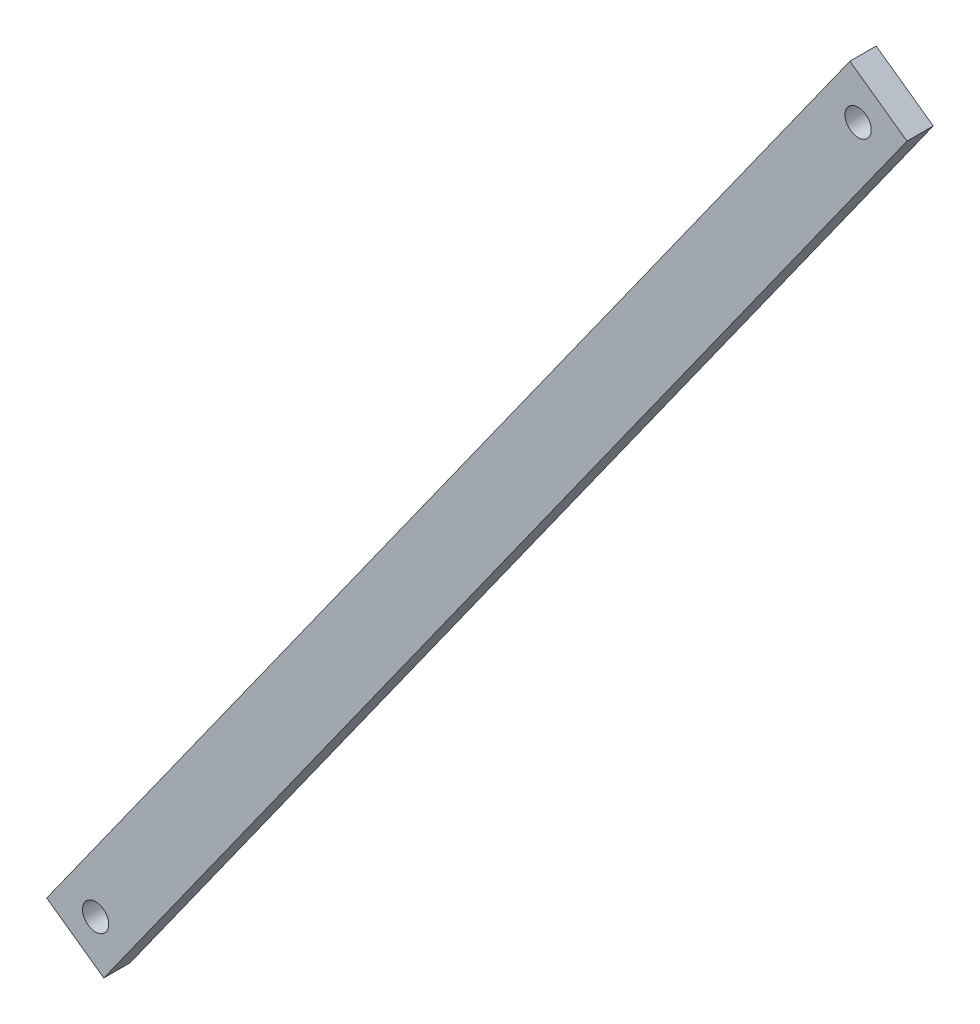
from build123d import *

# Parameters (mm, degrees)
ESQUISSE1_R      = 1.5
EXTRUSION1_DEPTH = 3


with BuildPart() as part:
    # Esquisse1 → Extrusion1 (new body)
    with BuildSketch(Plane.XY):
        Polygon((0.934309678, -5.579163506), (92.579163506, 122.934309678), (86.065690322, 127.579163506), (-5.579163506, -0.934309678), align=None)
        Circle(ESQUISSE1_R, mode=Mode.SUBTRACT)
        with Locations((87, 122)):
            Circle(ESQUISSE1_R, mode=Mode.SUBTRACT)
    extrude(amount=EXTRUSION1_DEPTH)


solid = part.part
